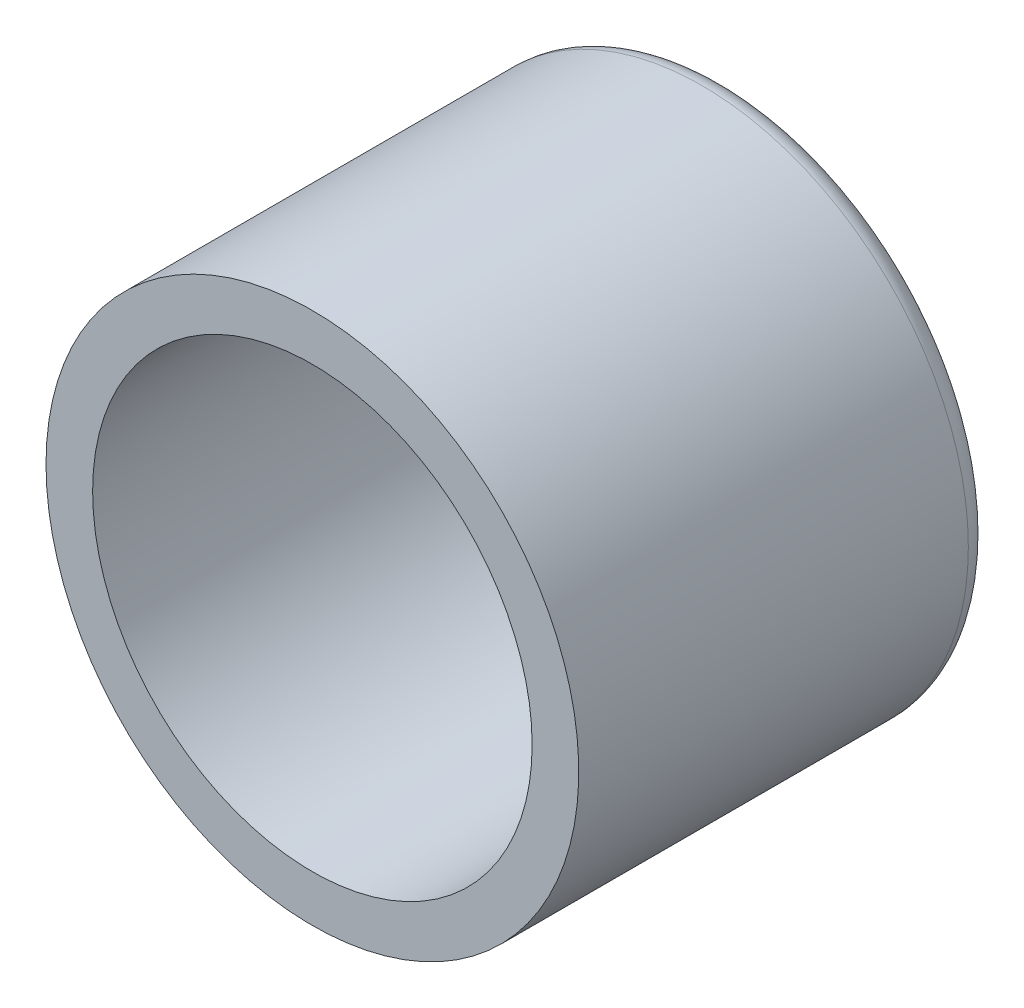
from build123d import *

# Parameters (mm, degrees)
CERCLES_R      = 8
CERCLES_R_2    = 6.6
CYLINDRE_DEPTH = 12.4
CONG_R         = 0.7
ESQUISSE1_R    = 6.6
GRILLE_DEPTH   = 0.2


with BuildPart() as part:
    # cercles → Cylindre (new body)
    with BuildSketch(Plane.XY):
        with Locations(Location((0, 0, 0), (0, 0, 180))):
            Circle(CERCLES_R)
        with Locations(Location((0, 0, 0), (0, 0, 180))):
            Circle(CERCLES_R_2, mode=Mode.SUBTRACT)
    extrude(amount=CYLINDRE_DEPTH)

    # cong
    cong_edges = [part.edges().sort_by_distance(p)[0] for p in [
        (8, 0, 0),
    ]]
    fillet(cong_edges, radius=CONG_R)

    # Esquisse1 → grille (add)
    with BuildSketch(Plane.XY):
        with Locations(Location((0, 0, 0), (0, 0, 180))):
            Circle(ESQUISSE1_R)
    extrude(amount=GRILLE_DEPTH)


solid = part.part
